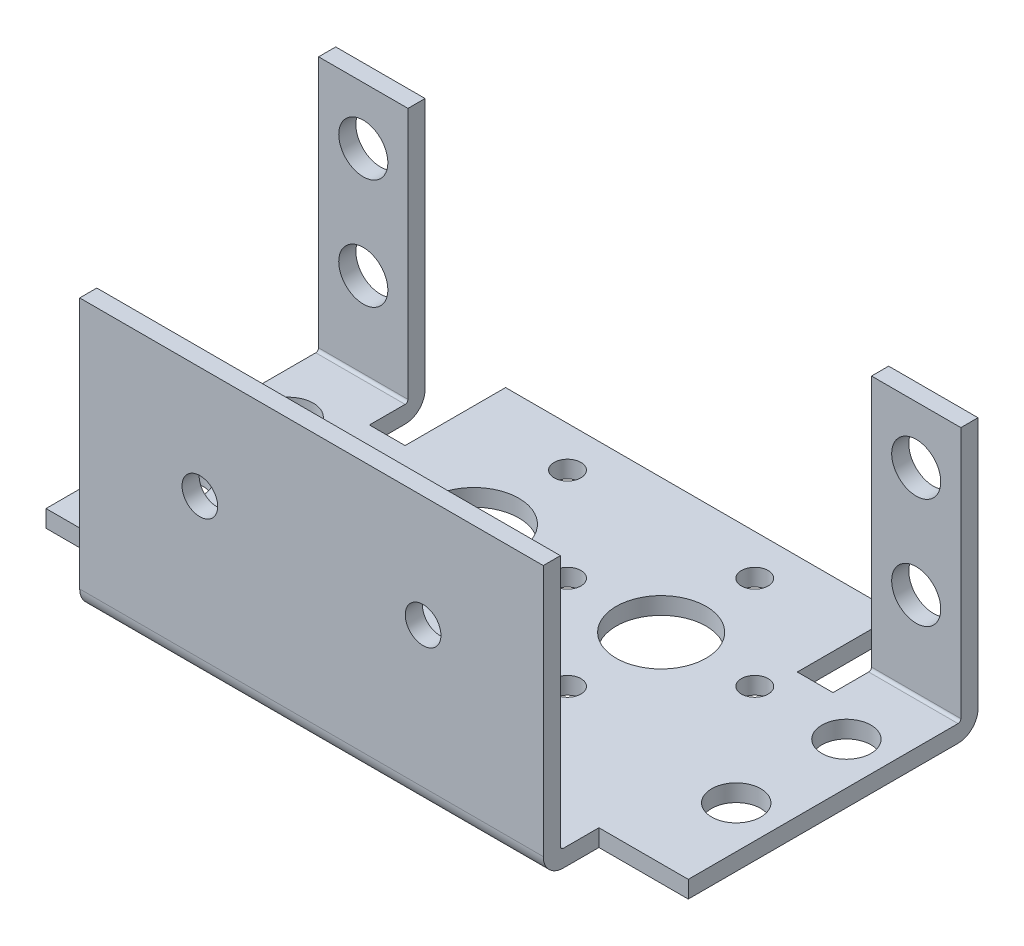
from build123d import *

# Parameters (mm, degrees)
SKETCH1_R      = 1.1938
SKETCH1_R_2    = 2.1844
SKETCH1_R_3    = 4.0005
EXTRUDE1_DEPTH = 1.524
EXTRUDE3_START = -13.3731
SKETCH3_W      = 7.9502
SKETCH3_H      = 24.2062
SKETCH3_R      = 2.1844
EXTRUDE3_DEPTH = 1.524
EXTRUDE4_START = 15.8369
SKETCH3_3_W    = 41.2496
SKETCH3_3_H    = 24.2062
SKETCH3_3_R    = 1.5875
EXTRUDE4_DEPTH = 1.524
FILLET4_R      = 1.778
FILLET5_R      = 0.254


with BuildPart() as part:
    # Sketch1 → Extrude1 (new body)
    # profile 1 of 2: a face of its own
    with BuildSketch(Plane(origin=(0, 0, 0), x_dir=(1, 0, 0), z_dir=(0, 1, 0))):
        Polygon((28.575, 0), (28.575, -12.4079), (20.6248, -12.4079), (20.6248, -17.3609), (-20.6248, -17.3609), (-20.6248, -12.4079), (-28.575, -12.4079), (-28.575, 0), align=None)
        with Locations(Location((8.3312, -2.9083, 0), (0, 0, 90))):
            Circle(SKETCH1_R, mode=Mode.SUBTRACT)
        with Locations(Location((-8.3312, -2.9083, 0), (0, 0, 90))):
            Circle(SKETCH1_R, mode=Mode.SUBTRACT)
        with Locations(Location((-24.8158, -4.3815, 0), (0, 0, 90))):
            Circle(SKETCH1_R_2, mode=Mode.SUBTRACT)
        with Locations(Location((24.8158, -4.3815, 0), (0, 0, 90))):
            Circle(SKETCH1_R_2, mode=Mode.SUBTRACT)
    # profile 2 of 2: a face of its own
    with BuildSketch(Plane(origin=(0, 0, 0), x_dir=(1, 0, 0), z_dir=(0, 1, 0))):
        Polygon((28.575, 0), (-28.575, 0), (-28.575, 13.3731), (-20.6248, 13.3731), (-20.6248, 8.4201), (-17.4498, 8.4201), (-17.4498, 17.3609), (17.4498, 17.3609), (17.4498, 8.4201), (20.6248, 8.4201), (20.6248, 13.3731), (28.575, 13.3731), align=None)
        with Locations(Location((8.3312, 5.4229, 0), (0, 0, 90))):
            Circle(SKETCH1_R_3, mode=Mode.SUBTRACT)
        with Locations(Location((8.3312, 13.7541, 0), (0, 0, 90))):
            Circle(SKETCH1_R, mode=Mode.SUBTRACT)
        with Locations(Location((-8.3312, 5.4229, 0), (0, 0, 90))):
            Circle(SKETCH1_R_3, mode=Mode.SUBTRACT)
        with Locations(Location((-24.8158, 5.4229, 0), (0, 0, 90))):
            Circle(SKETCH1_R_2, mode=Mode.SUBTRACT)
        with Locations(Location((-16.6624, 5.4229, 0), (0, 0, 90))):
            Circle(SKETCH1_R, mode=Mode.SUBTRACT)
        with Locations(Location((-8.3312, 13.7541, 0), (0, 0, 90))):
            Circle(SKETCH1_R, mode=Mode.SUBTRACT)
        with Locations(Location((0, 5.4229, 0), (0, 0, 90))):
            Circle(SKETCH1_R, mode=Mode.SUBTRACT)
        with Locations(Location((16.6624, 5.4229, 0), (0, 0, 90))):
            Circle(SKETCH1_R, mode=Mode.SUBTRACT)
        with Locations(Location((24.8158, 5.4229, 0), (0, 0, 90))):
            Circle(SKETCH1_R_2, mode=Mode.SUBTRACT)
    extrude(amount=EXTRUDE1_DEPTH)

    # Sketch3 → Extrude3 (add)
    # profile 1 of 2: a face of its own
    with BuildSketch(Plane.XY.offset(EXTRUDE3_START)):
        with Locations((-24.5999, 12.1031)):
            Rectangle(SKETCH3_W, SKETCH3_H)
        with Locations(Location((-24.5999, 19.1262, 0), (0, 0, 180))):
            Circle(SKETCH3_R, mode=Mode.SUBTRACT)
        with Locations(Location((-24.5999, 9.3218, 0), (0, 0, 180))):
            Circle(SKETCH3_R, mode=Mode.SUBTRACT)
    # profile 2 of 2: a face of its own
    with BuildSketch(Plane.XY.offset(EXTRUDE3_START)):
        with Locations((24.5999, 12.1031)):
            Rectangle(SKETCH3_W, SKETCH3_H)
        with Locations(Location((24.5999, 9.3218, 0), (0, 0, 180))):
            Circle(SKETCH3_R, mode=Mode.SUBTRACT)
        with Locations(Location((24.5999, 19.1262, 0), (0, 0, 180))):
            Circle(SKETCH3_R, mode=Mode.SUBTRACT)
    extrude(amount=EXTRUDE3_DEPTH)

    # Sketch3_3 → Extrude4 (add)
    with BuildSketch(Plane.XY.offset(EXTRUDE4_START)):
        with Locations((0, 12.1031)):
            Rectangle(SKETCH3_3_W, SKETCH3_3_H)
        with Locations((-9.9314, 14.2748)):
            Circle(SKETCH3_3_R, mode=Mode.SUBTRACT)
        with Locations((9.9314, 14.2748)):
            Circle(SKETCH3_3_R, mode=Mode.SUBTRACT)
    extrude(amount=EXTRUDE4_DEPTH)

    # Fillet4
    fillet4_edges = [part.edges().sort_by_distance(p)[0] for p in [
        (0, 0, 17.3609),
        (-24.5999, 0, -13.3731),
        (24.5999, 0, -13.3731),
    ]]
    fillet(fillet4_edges, radius=FILLET4_R)

    # Fillet5
    fillet5_edges = [part.edges().sort_by_distance(p)[0] for p in [
        (24.5999, 1.524, -11.8491),
        (0, 1.524, 15.8369),
        (-24.5999, 1.524, -11.8491),
    ]]
    fillet(fillet5_edges, radius=FILLET5_R)


solid = part.part
